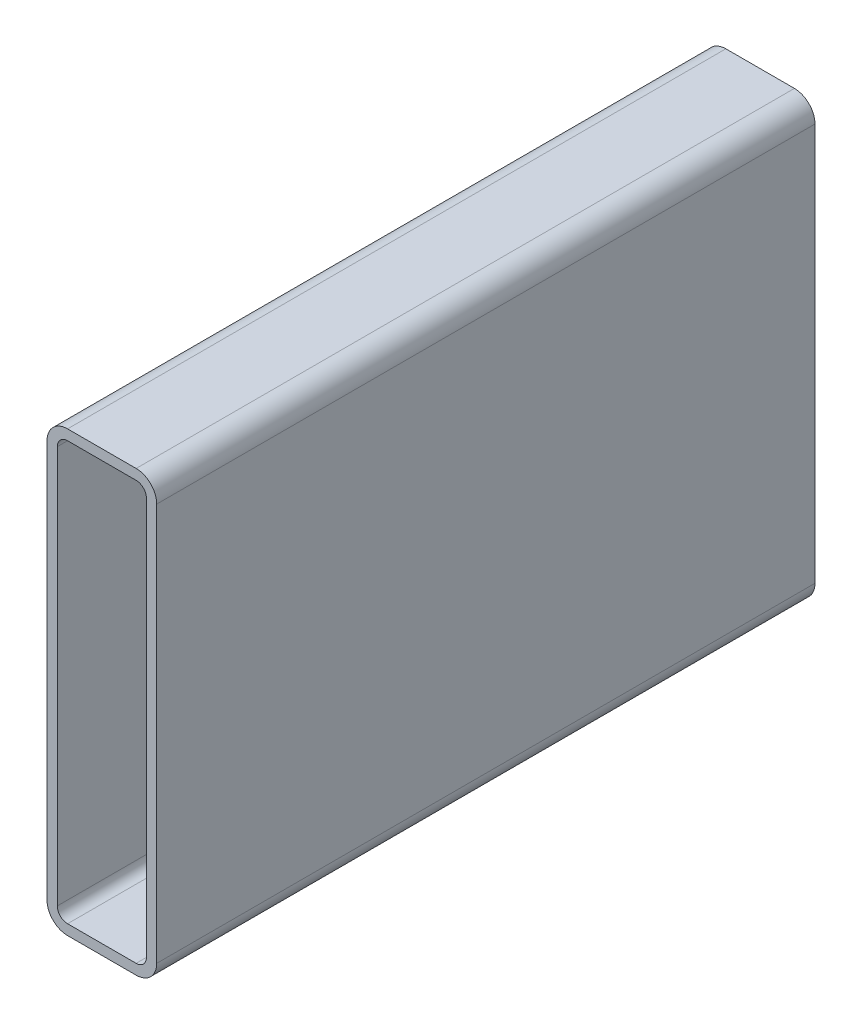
from build123d import *

# Parameters (mm, degrees)
BOSS_EXTRUDE1_DEPTH = 304.8


with BuildPart() as part:
    # Sketch1 → Boss-Extrude1 (new body)
    with BuildSketch(Plane.XY):
        with BuildLine():
            Line((9.525, 203.2), (41.275, 203.2))
            ThreePointArc((41.275, 203.2), (48.010192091, 200.410192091), (50.8, 193.675))
            Line((50.8, 193.675), (50.8, 9.525))
            ThreePointArc((50.8, 9.525), (48.010192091, 2.789807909), (41.275, 0))
            Line((41.275, 0), (9.525, 0))
            ThreePointArc((9.525, 0), (2.789807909, 2.789807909), (0, 9.525))
            Line((0, 9.525), (0, 193.675))
            ThreePointArc((0, 193.675), (2.789807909, 200.410192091), (9.525, 203.2))
        make_face()
        with BuildLine():
            Line((9.525, 198.4375), (41.275, 198.4375))
            ThreePointArc((41.275, 198.4375), (44.642596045, 197.042596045), (46.0375, 193.675))
            Line((46.0375, 193.675), (46.0375, 9.525))
            ThreePointArc((46.0375, 9.525), (44.642596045, 6.157403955), (41.275, 4.7625))
            Line((41.275, 4.7625), (9.525, 4.7625))
            ThreePointArc((9.525, 4.7625), (6.157403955, 6.157403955), (4.7625, 9.525))
            Line((4.7625, 9.525), (4.7625, 193.675))
            ThreePointArc((4.7625, 193.675), (6.157403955, 197.042596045), (9.525, 198.4375))
        make_face(mode=Mode.SUBTRACT)
    extrude(amount=BOSS_EXTRUDE1_DEPTH)


solid = part.part
